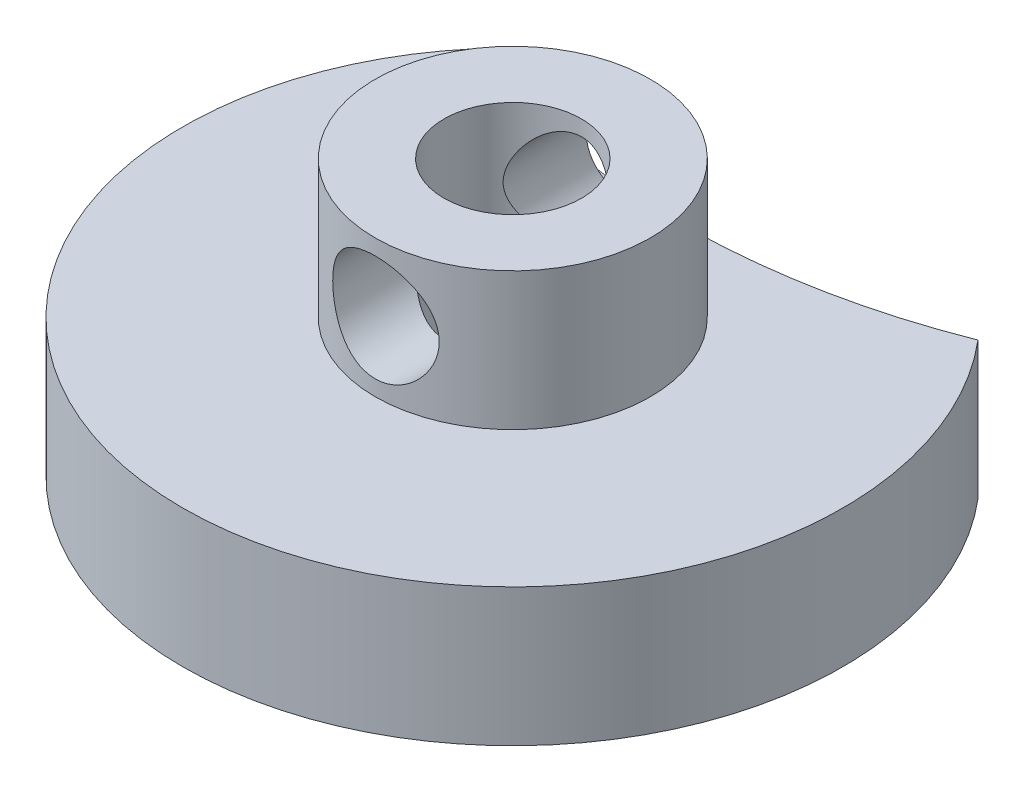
ISO-10303-21;
HEADER;
FILE_DESCRIPTION(('STEP AP214'),'2;1');
FILE_NAME('part.step','',(''),(''),'','','');
FILE_SCHEMA(('AUTOMOTIVE_DESIGN { 1 0 10303 214 1 1 1 1 }'));
ENDSEC;
DATA;
#1=APPLICATION_CONTEXT('core data for automotive mechanical design processes');
#2=APPLICATION_PROTOCOL_DEFINITION('international standard','automotive_design',2000,#1);
#3=PRODUCT_CONTEXT('',#1,'mechanical');
#4=PRODUCT('Part','Part','',(#3));
#5=PRODUCT_RELATED_PRODUCT_CATEGORY('part','',(#4));
#6=PRODUCT_DEFINITION_FORMATION('','',#4);
#7=PRODUCT_DEFINITION_CONTEXT('part definition',#1,'design');
#8=PRODUCT_DEFINITION('design','',#6,#7);
#9=PRODUCT_DEFINITION_SHAPE('','',#8);
#10=(LENGTH_UNIT() NAMED_UNIT(*) SI_UNIT(.MILLI.,.METRE.));
#11=(NAMED_UNIT(*) PLANE_ANGLE_UNIT() SI_UNIT($,.RADIAN.));
#12=(NAMED_UNIT(*) SI_UNIT($,.STERADIAN.) SOLID_ANGLE_UNIT());
#13=UNCERTAINTY_MEASURE_WITH_UNIT(LENGTH_MEASURE(1.E-05),#10,'distance_accuracy_value','');
#14=(GEOMETRIC_REPRESENTATION_CONTEXT(3) GLOBAL_UNCERTAINTY_ASSIGNED_CONTEXT((#13)) GLOBAL_UNIT_ASSIGNED_CONTEXT((#10,
#11,#12)) REPRESENTATION_CONTEXT('',''));
#15=CARTESIAN_POINT('',(0.,0.,0.));
#16=DIRECTION('',(0.,0.,1.));
#17=DIRECTION('',(1.,0.,0.));
#18=AXIS2_PLACEMENT_3D('',#15,#16,#17);
#19=CARTESIAN_POINT('',(0.,3.175,0.));
#20=DIRECTION('',(0.,1.,0.));
#21=DIRECTION('',(0.,0.,1.));
#22=AXIS2_PLACEMENT_3D('',#19,#20,#21);
#23=PLANE('',#22);
#24=CARTESIAN_POINT('',(0.,3.175,-39.37));
#25=DIRECTION('',(0.,1.,0.));
#26=DIRECTION('',(0.,0.,1.));
#27=AXIS2_PLACEMENT_3D('',#24,#25,#26);
#28=CIRCLE('',#27,31.75);
#29=CARTESIAN_POINT('',(-11.6440672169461,3.175,-9.83225806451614));
#30=VERTEX_POINT('',#29);
#31=CARTESIAN_POINT('',(11.644067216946,3.175,-9.83225806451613));
#32=VERTEX_POINT('',#31);
#33=EDGE_CURVE('E66',#30,#32,#28,.T.);
#34=ORIENTED_EDGE('',*,*,#33,.F.);
#35=CARTESIAN_POINT('',(0.,3.175,0.));
#36=DIRECTION('',(0.,1.,0.));
#37=DIRECTION('',(0.,0.,1.));
#38=AXIS2_PLACEMENT_3D('',#35,#36,#37);
#39=CIRCLE('',#38,15.24);
#40=EDGE_CURVE('E12',#30,#32,#39,.T.);
#41=ORIENTED_EDGE('',*,*,#40,.T.);
#42=EDGE_LOOP('',(#34,#41));
#43=FACE_BOUND('',#42,.T.);
#44=CARTESIAN_POINT('',(0.,3.175,0.));
#45=DIRECTION('',(0.,1.,0.));
#46=DIRECTION('',(0.,0.,1.));
#47=AXIS2_PLACEMENT_3D('',#44,#45,#46);
#48=CIRCLE('',#47,6.35);
#49=CARTESIAN_POINT('',(0.,3.175,6.35));
#50=VERTEX_POINT('',#49);
#51=EDGE_CURVE('E76',#50,#50,#48,.T.);
#52=ORIENTED_EDGE('',*,*,#51,.F.);
#53=EDGE_LOOP('',(#52));
#54=FACE_BOUND('',#53,.T.);
#55=ADVANCED_FACE('F33',(#43,#54),#23,.T.);
#56=CARTESIAN_POINT('',(0.,-3.175,0.));
#57=DIRECTION('',(0.,1.,0.));
#58=DIRECTION('',(0.,0.,1.));
#59=AXIS2_PLACEMENT_3D('',#56,#57,#58);
#60=PLANE('',#59);
#61=CARTESIAN_POINT('',(0.,-3.175,0.));
#62=DIRECTION('',(0.,1.,0.));
#63=DIRECTION('',(0.,0.,1.));
#64=AXIS2_PLACEMENT_3D('',#61,#62,#63);
#65=CIRCLE('',#64,15.24);
#66=CARTESIAN_POINT('',(-11.644067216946,-3.175,-9.83225806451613));
#67=VERTEX_POINT('',#66);
#68=CARTESIAN_POINT('',(11.644067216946,-3.175,-9.83225806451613));
#69=VERTEX_POINT('',#68);
#70=EDGE_CURVE('E46',#67,#69,#65,.T.);
#71=ORIENTED_EDGE('',*,*,#70,.F.);
#72=CARTESIAN_POINT('',(0.,-3.175,-39.37));
#73=DIRECTION('',(0.,1.,0.));
#74=DIRECTION('',(0.,0.,1.));
#75=AXIS2_PLACEMENT_3D('',#72,#73,#74);
#76=CIRCLE('',#75,31.75);
#77=EDGE_CURVE('E54',#67,#69,#76,.T.);
#78=ORIENTED_EDGE('',*,*,#77,.T.);
#79=EDGE_LOOP('',(#71,#78));
#80=FACE_BOUND('',#79,.T.);
#81=CARTESIAN_POINT('',(0.,-3.175,0.));
#82=DIRECTION('',(0.,1.,0.));
#83=DIRECTION('',(0.,0.,1.));
#84=AXIS2_PLACEMENT_3D('',#81,#82,#83);
#85=CIRCLE('',#84,6.35);
#86=CARTESIAN_POINT('',(0.,-3.175,-6.35));
#87=VERTEX_POINT('',#86);
#88=EDGE_CURVE('E74',#87,#87,#85,.F.);
#89=ORIENTED_EDGE('',*,*,#88,.F.);
#90=EDGE_LOOP('',(#89));
#91=FACE_BOUND('',#90,.T.);
#92=ADVANCED_FACE('F119',(#80,#91),#60,.F.);
#93=CARTESIAN_POINT('',(0.,3.175,0.));
#94=DIRECTION('',(0.,-1.,0.));
#95=DIRECTION('',(0.,0.,-1.));
#96=AXIS2_PLACEMENT_3D('',#93,#94,#95);
#97=CYLINDRICAL_SURFACE('',#96,15.24);
#98=ORIENTED_EDGE('',*,*,#70,.T.);
#99=DIRECTION('',(0.,1.,0.));
#100=VECTOR('',#99,1.);
#101=CARTESIAN_POINT('',(11.644067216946,-3.175,-9.83225806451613));
#102=LINE('',#101,#100);
#103=EDGE_CURVE('E59',#69,#32,#102,.T.);
#104=ORIENTED_EDGE('',*,*,#103,.T.);
#105=ORIENTED_EDGE('',*,*,#40,.F.);
#106=DIRECTION('',(0.,1.,0.));
#107=VECTOR('',#106,1.);
#108=CARTESIAN_POINT('',(-11.6440672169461,-3.175,-9.83225806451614));
#109=LINE('',#108,#107);
#110=EDGE_CURVE('E63',#67,#30,#109,.T.);
#111=ORIENTED_EDGE('',*,*,#110,.F.);
#112=EDGE_LOOP('',(#98,#104,#105,#111));
#113=FACE_BOUND('',#112,.T.);
#114=ADVANCED_FACE('F35',(#113),#97,.T.);
#115=CARTESIAN_POINT('',(0.,-3.175,-39.37));
#116=DIRECTION('',(0.,1.,0.));
#117=DIRECTION('',(0.,0.,1.));
#118=AXIS2_PLACEMENT_3D('',#115,#116,#117);
#119=CYLINDRICAL_SURFACE('',#118,31.75);
#120=ORIENTED_EDGE('',*,*,#33,.T.);
#121=ORIENTED_EDGE('',*,*,#103,.F.);
#122=ORIENTED_EDGE('',*,*,#77,.F.);
#123=ORIENTED_EDGE('',*,*,#110,.T.);
#124=EDGE_LOOP('',(#120,#121,#122,#123));
#125=FACE_BOUND('',#124,.T.);
#126=ADVANCED_FACE('F65',(#125),#119,.F.);
#127=CARTESIAN_POINT('',(0.,33.8355122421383,0.));
#128=DIRECTION('',(0.,-1.,0.));
#129=DIRECTION('',(0.,0.,-1.));
#130=AXIS2_PLACEMENT_3D('',#127,#128,#129);
#131=CYLINDRICAL_SURFACE('',#130,6.35);
#132=CARTESIAN_POINT('',(0.,-6.477,0.));
#133=DIRECTION('',(0.,1.,0.));
#134=DIRECTION('',(0.,0.,1.));
#135=AXIS2_PLACEMENT_3D('',#132,#133,#134);
#136=CIRCLE('',#135,6.35);
#137=CARTESIAN_POINT('',(0.,-6.477,-6.35));
#138=VERTEX_POINT('',#137);
#139=EDGE_CURVE('E218',#138,#138,#136,.F.);
#140=CARTESIAN_POINT('',(0.,-6.477,-6.35));
#141=CARTESIAN_POINT('',(0.,-6.44260416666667,-6.35));
#142=CARTESIAN_POINT('',(0.,-6.40820833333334,-6.35));
#143=CARTESIAN_POINT('',(0.,-6.33941666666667,-6.35));
#144=CARTESIAN_POINT('',(0.,-6.30502083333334,-6.35));
#145=CARTESIAN_POINT('',(0.,-6.23622916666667,-6.35));
#146=CARTESIAN_POINT('',(0.,-6.20183333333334,-6.35));
#147=CARTESIAN_POINT('',(0.,-6.13304166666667,-6.35));
#148=CARTESIAN_POINT('',(0.,-6.09864583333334,-6.35));
#149=CARTESIAN_POINT('',(0.,-6.02985416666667,-6.35));
#150=CARTESIAN_POINT('',(0.,-5.99545833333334,-6.35));
#151=CARTESIAN_POINT('',(0.,-5.92666666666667,-6.35));
#152=CARTESIAN_POINT('',(0.,-5.89227083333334,-6.35));
#153=CARTESIAN_POINT('',(0.,-5.82347916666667,-6.35));
#154=CARTESIAN_POINT('',(0.,-5.78908333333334,-6.35));
#155=CARTESIAN_POINT('',(0.,-5.72029166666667,-6.35));
#156=CARTESIAN_POINT('',(0.,-5.68589583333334,-6.35));
#157=CARTESIAN_POINT('',(0.,-5.61710416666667,-6.35));
#158=CARTESIAN_POINT('',(0.,-5.58270833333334,-6.35));
#159=CARTESIAN_POINT('',(0.,-5.51391666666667,-6.35));
#160=CARTESIAN_POINT('',(0.,-5.47952083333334,-6.35));
#161=CARTESIAN_POINT('',(0.,-5.41072916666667,-6.35));
#162=CARTESIAN_POINT('',(0.,-5.37633333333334,-6.35));
#163=CARTESIAN_POINT('',(0.,-5.30754166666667,-6.35));
#164=CARTESIAN_POINT('',(0.,-5.27314583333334,-6.35));
#165=CARTESIAN_POINT('',(0.,-5.20435416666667,-6.35));
#166=CARTESIAN_POINT('',(0.,-5.16995833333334,-6.35));
#167=CARTESIAN_POINT('',(0.,-5.10116666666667,-6.35));
#168=CARTESIAN_POINT('',(0.,-5.06677083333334,-6.35));
#169=CARTESIAN_POINT('',(0.,-4.99797916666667,-6.35));
#170=CARTESIAN_POINT('',(0.,-4.96358333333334,-6.35));
#171=CARTESIAN_POINT('',(0.,-4.89479166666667,-6.35));
#172=CARTESIAN_POINT('',(0.,-4.86039583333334,-6.35));
#173=CARTESIAN_POINT('',(0.,-4.79160416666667,-6.35));
#174=CARTESIAN_POINT('',(0.,-4.75720833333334,-6.35));
#175=CARTESIAN_POINT('',(0.,-4.68841666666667,-6.35));
#176=CARTESIAN_POINT('',(0.,-4.65402083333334,-6.35));
#177=CARTESIAN_POINT('',(0.,-4.58522916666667,-6.35));
#178=CARTESIAN_POINT('',(0.,-4.55083333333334,-6.35));
#179=CARTESIAN_POINT('',(0.,-4.48204166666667,-6.35));
#180=CARTESIAN_POINT('',(0.,-4.44764583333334,-6.35));
#181=CARTESIAN_POINT('',(0.,-4.37885416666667,-6.35));
#182=CARTESIAN_POINT('',(0.,-4.34445833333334,-6.35));
#183=CARTESIAN_POINT('',(0.,-4.27566666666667,-6.35));
#184=CARTESIAN_POINT('',(0.,-4.24127083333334,-6.35));
#185=CARTESIAN_POINT('',(0.,-4.17247916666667,-6.35));
#186=CARTESIAN_POINT('',(0.,-4.13808333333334,-6.35));
#187=CARTESIAN_POINT('',(0.,-4.06929166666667,-6.35));
#188=CARTESIAN_POINT('',(0.,-4.03489583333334,-6.35));
#189=CARTESIAN_POINT('',(0.,-3.96610416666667,-6.35));
#190=CARTESIAN_POINT('',(0.,-3.93170833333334,-6.35));
#191=CARTESIAN_POINT('',(0.,-3.86291666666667,-6.35));
#192=CARTESIAN_POINT('',(0.,-3.82852083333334,-6.35));
#193=CARTESIAN_POINT('',(0.,-3.75972916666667,-6.35));
#194=CARTESIAN_POINT('',(0.,-3.72533333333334,-6.35));
#195=CARTESIAN_POINT('',(0.,-3.65654166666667,-6.35));
#196=CARTESIAN_POINT('',(0.,-3.62214583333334,-6.35));
#197=CARTESIAN_POINT('',(0.,-3.55335416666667,-6.35));
#198=CARTESIAN_POINT('',(0.,-3.51895833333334,-6.35));
#199=CARTESIAN_POINT('',(0.,-3.45016666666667,-6.35));
#200=CARTESIAN_POINT('',(0.,-3.41577083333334,-6.35));
#201=CARTESIAN_POINT('',(0.,-3.34697916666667,-6.35));
#202=CARTESIAN_POINT('',(0.,-3.31258333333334,-6.35));
#203=CARTESIAN_POINT('',(0.,-3.24379166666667,-6.35));
#204=CARTESIAN_POINT('',(0.,-3.20939583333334,-6.35));
#205=CARTESIAN_POINT('',(0.,-3.175,-6.35));
#206=B_SPLINE_CURVE_WITH_KNOTS('',3,(#140,#141,#142,#143,#144,#145,#146,#147,#148,#149,#150,
#151,#152,#153,#154,#155,#156,#157,#158,#159,#160,#161,#162,#163,#164,#165,#166,#167,#168,#169,
#170,#171,#172,#173,#174,#175,#176,#177,#178,#179,#180,#181,#182,#183,#184,#185,#186,#187,#188,
#189,#190,#191,#192,#193,#194,#195,#196,#197,#198,#199,#200,#201,#202,#203,#204,#205),
.UNSPECIFIED.,.F.,.F.,(4,2,2,2,2,2,2,2,2,2,2,2,2,2,2,2,2,2,2,2,2,2,2,2,2,2,2,2,2,2,2,2,4),(0.,
0.103187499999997,0.206375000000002,0.309562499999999,0.412750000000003,0.515937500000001,
0.619124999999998,0.722312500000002,0.8255,0.928687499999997,1.031875,1.1350625,1.23825,
1.3414375,1.444625,1.5478125,1.651,1.7541875,1.857375,1.9605625,2.06375,2.1669375,2.270125,
2.3733125,2.4765,2.5796875,2.682875,2.7860625,2.88925,2.9924375,3.095625,3.1988125,3.302),.UNSPECIFIED.);
#207=EDGE_CURVE('BSEAM114',#138,#87,#206,.T.);
#208=ORIENTED_EDGE('',*,*,#139,.F.);
#209=ORIENTED_EDGE('',*,*,#88,.T.);
#210=ORIENTED_EDGE('',*,*,#207,.T.);
#211=ORIENTED_EDGE('',*,*,#207,.F.);
#212=EDGE_LOOP('',(#208,#210,#209,#211));
#213=FACE_BOUND('',#212,.T.);
#214=ADVANCED_FACE('F114',(#213),#131,.T.);
#215=CARTESIAN_POINT('',(0.,3.89255,6.35));
#216=CARTESIAN_POINT('',(-0.132781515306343,3.8925437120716,6.35000481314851));
#217=CARTESIAN_POINT('',(-0.265521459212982,3.90334482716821,6.34579969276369));
#218=CARTESIAN_POINT('',(-0.52701790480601,3.94607547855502,6.32944710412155));
#219=CARTESIAN_POINT('',(-0.655775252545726,3.97800049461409,6.31730133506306));
#220=CARTESIAN_POINT('',(-0.905495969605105,4.06166966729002,6.28636607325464));
#221=CARTESIAN_POINT('',(-1.02647440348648,4.11337408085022,6.26758990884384));
#222=CARTESIAN_POINT('',(-1.25802647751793,4.23492536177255,6.22525027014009));
#223=CARTESIAN_POINT('',(-1.36859713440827,4.3047774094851,6.20168542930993));
#224=CARTESIAN_POINT('',(-1.58114850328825,4.46390342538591,6.15100739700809));
#225=CARTESIAN_POINT('',(-1.68260214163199,4.55384769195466,6.12378935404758));
#226=CARTESIAN_POINT('',(-1.86941624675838,4.74918198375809,6.06937124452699));
#227=CARTESIAN_POINT('',(-1.95477131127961,4.85457717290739,6.0421711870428));
#228=CARTESIAN_POINT('',(-2.11042683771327,5.08309839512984,5.98962735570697));
#229=CARTESIAN_POINT('',(-2.17996410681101,5.20677524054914,5.96440587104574));
#230=CARTESIAN_POINT('',(-2.29701498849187,5.46519610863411,5.92031786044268));
#231=CARTESIAN_POINT('',(-2.34453805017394,5.59993535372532,5.90144860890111));
#232=CARTESIAN_POINT('',(-2.41409986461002,5.87057471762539,5.87332810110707));
#233=CARTESIAN_POINT('',(-2.43714907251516,6.00617429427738,5.86369722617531));
#234=CARTESIAN_POINT('',(-2.46026717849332,6.27963240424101,5.85403779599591));
#235=CARTESIAN_POINT('',(-2.46034637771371,6.41748989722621,5.85400493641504));
#236=CARTESIAN_POINT('',(-2.43829146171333,6.68209108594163,5.86321961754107));
#237=CARTESIAN_POINT('',(-2.41758760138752,6.80897875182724,5.87186961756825));
#238=CARTESIAN_POINT('',(-2.35692835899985,7.05731424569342,5.89647764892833));
#239=CARTESIAN_POINT('',(-2.31696988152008,7.1787611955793,5.91243685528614));
#240=CARTESIAN_POINT('',(-2.21819401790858,7.41558221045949,5.95020571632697));
#241=CARTESIAN_POINT('',(-2.15902133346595,7.53078995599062,5.97212421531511));
#242=CARTESIAN_POINT('',(-2.02374515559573,7.75004450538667,6.01930874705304));
#243=CARTESIAN_POINT('',(-1.94763555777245,7.85408726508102,6.04457598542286));
#244=CARTESIAN_POINT('',(-1.77420365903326,8.05593446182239,6.09782699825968));
#245=CARTESIAN_POINT('',(-1.67574913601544,8.15275149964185,6.1258754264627));
#246=CARTESIAN_POINT('',(-1.46368932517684,8.32880481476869,6.17997383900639));
#247=CARTESIAN_POINT('',(-1.35008140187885,8.4080380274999,6.20602347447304));
#248=CARTESIAN_POINT('',(-1.10828817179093,8.54785981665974,6.25376877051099));
#249=CARTESIAN_POINT('',(-0.979883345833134,8.60809944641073,6.27538065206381));
#250=CARTESIAN_POINT('',(-0.713715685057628,8.70578875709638,6.31118847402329));
#251=CARTESIAN_POINT('',(-0.575957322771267,8.7432492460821,6.32538793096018));
#252=CARTESIAN_POINT('',(-0.303287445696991,8.79237211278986,6.34414204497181));
#253=CARTESIAN_POINT('',(-0.168649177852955,8.80536284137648,6.34919270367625));
#254=CARTESIAN_POINT('',(0.100963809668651,8.80907107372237,6.3506269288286));
#255=CARTESIAN_POINT('',(0.235938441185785,8.79979390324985,6.34701256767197));
#256=CARTESIAN_POINT('',(0.496520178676,8.76022424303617,6.33184908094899));
#257=CARTESIAN_POINT('',(0.622283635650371,8.73081916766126,6.32063520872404));
#258=CARTESIAN_POINT('',(0.866990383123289,8.65301525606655,6.2917421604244));
#259=CARTESIAN_POINT('',(0.985932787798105,8.604613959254,6.27406214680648));
#260=CARTESIAN_POINT('',(1.21763122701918,8.48862659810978,6.23330841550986));
#261=CARTESIAN_POINT('',(1.33009422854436,8.42050807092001,6.2100886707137));
#262=CARTESIAN_POINT('',(1.54237981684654,8.26761615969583,6.16080025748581));
#263=CARTESIAN_POINT('',(1.64219751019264,8.18283636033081,6.13473049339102));
#264=CARTESIAN_POINT('',(1.83282355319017,7.99287006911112,6.08059859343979));
#265=CARTESIAN_POINT('',(1.92269330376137,7.88674596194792,6.05251292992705));
#266=CARTESIAN_POINT('',(2.0835553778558,7.66039532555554,5.99904180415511));
#267=CARTESIAN_POINT('',(2.1545453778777,7.54016706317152,5.97365667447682));
#268=CARTESIAN_POINT('',(2.2758721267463,7.28765892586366,5.92850284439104));
#269=CARTESIAN_POINT('',(2.32606902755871,7.15530453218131,5.90877244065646));
#270=CARTESIAN_POINT('',(2.40310491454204,6.88303618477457,5.87786888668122));
#271=CARTESIAN_POINT('',(2.42995965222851,6.74312739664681,5.86668996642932));
#272=CARTESIAN_POINT('',(2.45809413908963,6.46996536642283,5.85495377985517));
#273=CARTESIAN_POINT('',(2.46098782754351,6.3369059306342,5.85372634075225));
#274=CARTESIAN_POINT('',(2.44530202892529,6.07229885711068,5.86029601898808));
#275=CARTESIAN_POINT('',(2.42672486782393,5.94075105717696,5.86809215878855));
#276=CARTESIAN_POINT('',(2.36991134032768,5.68754799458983,5.89125663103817));
#277=CARTESIAN_POINT('',(2.33237817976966,5.56570790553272,5.90635333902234));
#278=CARTESIAN_POINT('',(2.23935547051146,5.32999349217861,5.94224368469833));
#279=CARTESIAN_POINT('',(2.18386125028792,5.21612124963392,5.96303880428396));
#280=CARTESIAN_POINT('',(2.0529696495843,4.99278387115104,6.00939937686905));
#281=CARTESIAN_POINT('',(1.9766482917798,4.88390212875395,6.03516378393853));
#282=CARTESIAN_POINT('',(1.80766081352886,4.67997819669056,6.08791357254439));
#283=CARTESIAN_POINT('',(1.71498933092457,4.58494056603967,6.11489935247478));
#284=CARTESIAN_POINT('',(1.509392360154,4.40565724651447,6.16896800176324));
#285=CARTESIAN_POINT('',(1.39559331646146,4.32238184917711,6.19596227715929));
#286=CARTESIAN_POINT('',(1.15466140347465,4.17613711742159,6.24534797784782));
#287=CARTESIAN_POINT('',(1.02752599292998,4.1131716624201,6.26773852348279));
#288=CARTESIAN_POINT('',(0.753939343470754,4.00613834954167,6.30669839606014));
#289=CARTESIAN_POINT('',(0.606757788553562,3.96372490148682,6.32274307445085));
#290=CARTESIAN_POINT('',(0.306363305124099,3.9069426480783,6.34438801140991));
#291=CARTESIAN_POINT('',(0.15315399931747,3.89255725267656,6.34999444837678));
#292=CARTESIAN_POINT('',(0.,3.89255,6.35));
#293=B_SPLINE_CURVE_WITH_KNOTS('',3,(#215,#216,#217,#218,#219,#220,#221,#222,#223,#224,#225,
#226,#227,#228,#229,#230,#231,#232,#233,#234,#235,#236,#237,#238,#239,#240,#241,#242,#243,#244,
#245,#246,#247,#248,#249,#250,#251,#252,#253,#254,#255,#256,#257,#258,#259,#260,#261,#262,#263,
#264,#265,#266,#267,#268,#269,#270,#271,#272,#273,#274,#275,#276,#277,#278,#279,#280,#281,#282,
#283,#284,#285,#286,#287,#288,#289,#290,#291,#292),.UNSPECIFIED.,.T.,.F.,(4,2,2,2,2,2,2,2,2,2,2,
2,2,2,2,2,2,2,2,2,2,2,2,2,2,2,2,2,2,2,2,2,2,2,2,2,2,2,4),(0.,0.39777929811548,0.795473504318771,
1.19237277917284,1.58938547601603,2.00242776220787,2.41560840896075,2.84577576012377,
3.27575830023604,3.6872013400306,4.09845986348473,4.4832324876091,4.86806698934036,
5.2604668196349,5.65300830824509,6.07379210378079,6.49464917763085,6.92283980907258,
7.35082711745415,7.7548246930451,8.15872565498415,8.54587768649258,8.93307988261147,
9.33190958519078,9.730893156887,10.1545450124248,10.5782489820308,11.0047581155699,
11.4309792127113,11.8282363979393,12.225450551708,12.6089067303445,12.9924627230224,
13.3970357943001,13.80174179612,14.2303758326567,14.6590916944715,15.1181735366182,
15.5769835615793),.UNSPECIFIED.);
#294=CARTESIAN_POINT('',(0.,3.89255,6.35));
#295=VERTEX_POINT('',#294);
#296=EDGE_CURVE('E106',#295,#295,#293,.T.);
#297=ORIENTED_EDGE('',*,*,#296,.T.);
#298=EDGE_LOOP('',(#297));
#299=FACE_BOUND('',#298,.T.);
#300=CARTESIAN_POINT('',(0.,8.80745000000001,-6.35));
#301=CARTESIAN_POINT('',(-0.132781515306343,8.80745628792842,-6.35000481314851));
#302=CARTESIAN_POINT('',(-0.265521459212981,8.79665517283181,-6.34579969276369));
#303=CARTESIAN_POINT('',(-0.52701790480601,8.75392452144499,-6.32944710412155));
#304=CARTESIAN_POINT('',(-0.655775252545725,8.72199950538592,-6.31730133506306));
#305=CARTESIAN_POINT('',(-0.905495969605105,8.63833033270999,-6.28636607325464));
#306=CARTESIAN_POINT('',(-1.02647440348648,8.58662591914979,-6.26758990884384));
#307=CARTESIAN_POINT('',(-1.25802647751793,8.46507463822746,-6.22525027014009));
#308=CARTESIAN_POINT('',(-1.36859713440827,8.39522259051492,-6.20168542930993));
#309=CARTESIAN_POINT('',(-1.58114850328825,8.23609657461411,-6.15100739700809));
#310=CARTESIAN_POINT('',(-1.68260214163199,8.14615230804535,-6.12378935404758));
#311=CARTESIAN_POINT('',(-1.86941624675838,7.95081801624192,-6.06937124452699));
#312=CARTESIAN_POINT('',(-1.95477131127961,7.84542282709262,-6.0421711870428));
#313=CARTESIAN_POINT('',(-2.11042683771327,7.61690160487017,-5.98962735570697));
#314=CARTESIAN_POINT('',(-2.17996410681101,7.49322475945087,-5.96440587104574));
#315=CARTESIAN_POINT('',(-2.29701498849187,7.2348038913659,-5.92031786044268));
#316=CARTESIAN_POINT('',(-2.34453805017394,7.10006464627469,-5.90144860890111));
#317=CARTESIAN_POINT('',(-2.41409986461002,6.82942528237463,-5.87332810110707));
#318=CARTESIAN_POINT('',(-2.43714907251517,6.69382570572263,-5.86369722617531));
#319=CARTESIAN_POINT('',(-2.46026717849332,6.420367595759,-5.85403779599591));
#320=CARTESIAN_POINT('',(-2.46034637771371,6.2825101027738,-5.85400493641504));
#321=CARTESIAN_POINT('',(-2.43829146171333,6.01790891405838,-5.86321961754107));
#322=CARTESIAN_POINT('',(-2.41758760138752,5.89102124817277,-5.87186961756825));
#323=CARTESIAN_POINT('',(-2.35692835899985,5.64268575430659,-5.89647764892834));
#324=CARTESIAN_POINT('',(-2.31696988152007,5.52123880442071,-5.91243685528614));
#325=CARTESIAN_POINT('',(-2.21819401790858,5.28441778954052,-5.95020571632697));
#326=CARTESIAN_POINT('',(-2.15902133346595,5.16921004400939,-5.97212421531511));
#327=CARTESIAN_POINT('',(-2.02374515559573,4.94995549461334,-6.01930874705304));
#328=CARTESIAN_POINT('',(-1.94763555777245,4.84591273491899,-6.04457598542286));
#329=CARTESIAN_POINT('',(-1.77420365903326,4.64406553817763,-6.09782699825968));
#330=CARTESIAN_POINT('',(-1.67574913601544,4.54724850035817,-6.1258754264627));
#331=CARTESIAN_POINT('',(-1.46368932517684,4.37119518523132,-6.17997383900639));
#332=CARTESIAN_POINT('',(-1.35008140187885,4.29196197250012,-6.20602347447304));
#333=CARTESIAN_POINT('',(-1.10828817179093,4.15214018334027,-6.25376877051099));
#334=CARTESIAN_POINT('',(-0.979883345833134,4.09190055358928,-6.27538065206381));
#335=CARTESIAN_POINT('',(-0.713715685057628,3.99421124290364,-6.31118847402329));
#336=CARTESIAN_POINT('',(-0.575957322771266,3.95675075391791,-6.32538793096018));
#337=CARTESIAN_POINT('',(-0.303287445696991,3.90762788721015,-6.34414204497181));
#338=CARTESIAN_POINT('',(-0.168649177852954,3.89463715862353,-6.34919270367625));
#339=CARTESIAN_POINT('',(0.100963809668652,3.89092892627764,-6.3506269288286));
#340=CARTESIAN_POINT('',(0.235938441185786,3.90020609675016,-6.34701256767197));
#341=CARTESIAN_POINT('',(0.496520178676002,3.93977575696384,-6.33184908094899));
#342=CARTESIAN_POINT('',(0.622283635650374,3.96918083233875,-6.32063520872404));
#343=CARTESIAN_POINT('',(0.866990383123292,4.04698474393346,-6.2917421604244));
#344=CARTESIAN_POINT('',(0.985932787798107,4.09538604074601,-6.27406214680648));
#345=CARTESIAN_POINT('',(1.21763122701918,4.21137340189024,-6.23330841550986));
#346=CARTESIAN_POINT('',(1.33009422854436,4.27949192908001,-6.2100886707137));
#347=CARTESIAN_POINT('',(1.54237981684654,4.43238384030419,-6.16080025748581));
#348=CARTESIAN_POINT('',(1.64219751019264,4.51716363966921,-6.13473049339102));
#349=CARTESIAN_POINT('',(1.83282355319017,4.70712993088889,-6.08059859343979));
#350=CARTESIAN_POINT('',(1.92269330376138,4.81325403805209,-6.05251292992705));
#351=CARTESIAN_POINT('',(2.0835553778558,5.03960467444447,-5.99904180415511));
#352=CARTESIAN_POINT('',(2.1545453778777,5.15983293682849,-5.97365667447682));
#353=CARTESIAN_POINT('',(2.2758721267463,5.41234107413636,-5.92850284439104));
#354=CARTESIAN_POINT('',(2.32606902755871,5.5446954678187,-5.90877244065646));
#355=CARTESIAN_POINT('',(2.40310491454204,5.81696381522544,-5.87786888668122));
#356=CARTESIAN_POINT('',(2.42995965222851,5.9568726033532,-5.86668996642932));
#357=CARTESIAN_POINT('',(2.45809413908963,6.23003463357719,-5.85495377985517));
#358=CARTESIAN_POINT('',(2.46098782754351,6.36309406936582,-5.85372634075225));
#359=CARTESIAN_POINT('',(2.44530202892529,6.62770114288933,-5.86029601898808));
#360=CARTESIAN_POINT('',(2.42672486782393,6.75924894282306,-5.86809215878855));
#361=CARTESIAN_POINT('',(2.36991134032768,7.01245200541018,-5.89125663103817));
#362=CARTESIAN_POINT('',(2.33237817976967,7.13429209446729,-5.90635333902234));
#363=CARTESIAN_POINT('',(2.23935547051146,7.37000650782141,-5.94224368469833));
#364=CARTESIAN_POINT('',(2.18386125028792,7.4838787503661,-5.96303880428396));
#365=CARTESIAN_POINT('',(2.0529696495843,7.70721612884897,-6.00939937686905));
#366=CARTESIAN_POINT('',(1.9766482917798,7.81609787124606,-6.03516378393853));
#367=CARTESIAN_POINT('',(1.80766081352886,8.02002180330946,-6.08791357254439));
#368=CARTESIAN_POINT('',(1.71498933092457,8.11505943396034,-6.11489935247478));
#369=CARTESIAN_POINT('',(1.509392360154,8.29434275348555,-6.16896800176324));
#370=CARTESIAN_POINT('',(1.39559331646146,8.3776181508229,-6.19596227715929));
#371=CARTESIAN_POINT('',(1.15466140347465,8.52386288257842,-6.24534797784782));
#372=CARTESIAN_POINT('',(1.02752599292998,8.58682833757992,-6.26773852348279));
#373=CARTESIAN_POINT('',(0.753939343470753,8.69386165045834,-6.30669839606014));
#374=CARTESIAN_POINT('',(0.60675778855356,8.73627509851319,-6.32274307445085));
#375=CARTESIAN_POINT('',(0.306363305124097,8.79305735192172,-6.34438801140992));
#376=CARTESIAN_POINT('',(0.153153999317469,8.80744274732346,-6.34999444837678));
#377=CARTESIAN_POINT('',(0.,8.80745000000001,-6.35));
#378=B_SPLINE_CURVE_WITH_KNOTS('',3,(#300,#301,#302,#303,#304,#305,#306,#307,#308,#309,#310,
#311,#312,#313,#314,#315,#316,#317,#318,#319,#320,#321,#322,#323,#324,#325,#326,#327,#328,#329,
#330,#331,#332,#333,#334,#335,#336,#337,#338,#339,#340,#341,#342,#343,#344,#345,#346,#347,#348,
#349,#350,#351,#352,#353,#354,#355,#356,#357,#358,#359,#360,#361,#362,#363,#364,#365,#366,#367,
#368,#369,#370,#371,#372,#373,#374,#375,#376,#377),.UNSPECIFIED.,.T.,.F.,(4,2,2,2,2,2,2,2,2,2,2,
2,2,2,2,2,2,2,2,2,2,2,2,2,2,2,2,2,2,2,2,2,2,2,2,2,2,2,4),(0.,0.39777929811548,0.795473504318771,
1.19237277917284,1.58938547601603,2.00242776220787,2.41560840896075,2.84577576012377,
3.27575830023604,3.6872013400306,4.09845986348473,4.48323248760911,4.86806698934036,
5.2604668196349,5.65300830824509,6.07379210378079,6.49464917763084,6.92283980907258,
7.35082711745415,7.7548246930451,8.15872565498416,8.54587768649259,8.93307988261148,
9.33190958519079,9.730893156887,10.1545450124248,10.5782489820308,11.0047581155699,
11.4309792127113,11.8282363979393,12.225450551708,12.6089067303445,12.9924627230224,
13.3970357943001,13.80174179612,14.2303758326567,14.6590916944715,15.1181735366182,
15.5769835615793),.UNSPECIFIED.);
#379=CARTESIAN_POINT('',(0.,8.80745000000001,-6.35));
#380=VERTEX_POINT('',#379);
#381=EDGE_CURVE('E102',#380,#380,#378,.T.);
#382=ORIENTED_EDGE('',*,*,#381,.T.);
#383=EDGE_LOOP('',(#382));
#384=FACE_BOUND('',#383,.T.);
#385=ORIENTED_EDGE('',*,*,#51,.T.);
#386=EDGE_LOOP('',(#385));
#387=FACE_BOUND('',#386,.T.);
#388=CARTESIAN_POINT('',(0.,9.525,0.));
#389=DIRECTION('',(0.,1.,0.));
#390=DIRECTION('',(0.,0.,1.));
#391=AXIS2_PLACEMENT_3D('',#388,#389,#390);
#392=CIRCLE('',#391,6.35);
#393=CARTESIAN_POINT('',(0.,9.525,6.35));
#394=VERTEX_POINT('',#393);
#395=EDGE_CURVE('E211',#394,#394,#392,.T.);
#396=ORIENTED_EDGE('',*,*,#395,.F.);
#397=EDGE_LOOP('',(#396));
#398=FACE_BOUND('',#397,.T.);
#399=ADVANCED_FACE('F110',(#299,#384,#387,#398),#131,.T.);
#400=CARTESIAN_POINT('',(0.,33.8355122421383,0.));
#401=DIRECTION('',(0.,-1.,0.));
#402=DIRECTION('',(0.,0.,-1.));
#403=AXIS2_PLACEMENT_3D('',#400,#401,#402);
#404=CYLINDRICAL_SURFACE('',#403,3.175);
#405=CARTESIAN_POINT('',(0.,8.80745000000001,-3.175));
#406=CARTESIAN_POINT('',(-0.119115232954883,8.80744089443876,-3.17499120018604));
#407=CARTESIAN_POINT('',(-0.238324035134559,8.7987254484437,-3.16823242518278));
#408=CARTESIAN_POINT('',(-0.472878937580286,8.76444558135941,-3.14181436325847));
#409=CARTESIAN_POINT('',(-0.588219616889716,8.73885847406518,-3.12213770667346));
#410=CARTESIAN_POINT('',(-0.811116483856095,8.67262757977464,-3.07175919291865));
#411=CARTESIAN_POINT('',(-0.918713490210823,8.63207090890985,-3.04112115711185));
#412=CARTESIAN_POINT('',(-1.12481814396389,8.53785308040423,-2.9710729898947));
#413=CARTESIAN_POINT('',(-1.22332576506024,8.48419188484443,-2.93166283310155));
#414=CARTESIAN_POINT('',(-1.41899819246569,8.36001803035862,-2.84247925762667));
#415=CARTESIAN_POINT('',(-1.51516764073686,8.2883959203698,-2.79208011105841));
#416=CARTESIAN_POINT('',(-1.694883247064,8.13340678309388,-2.68679507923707));
#417=CARTESIAN_POINT('',(-1.77841118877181,8.0500231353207,-2.63190289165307));
#418=CARTESIAN_POINT('',(-1.94908467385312,7.85351764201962,-2.5089806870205));
#419=CARTESIAN_POINT('',(-2.03312097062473,7.73786145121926,-2.44067185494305));
#420=CARTESIAN_POINT('',(-2.1810020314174,7.49144860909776,-2.30945103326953));
#421=CARTESIAN_POINT('',(-2.24486939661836,7.36070908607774,-2.24653306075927));
#422=CARTESIAN_POINT('',(-2.33108700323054,7.13364067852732,-2.15617302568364));
#423=CARTESIAN_POINT('',(-2.36011690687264,7.04172018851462,-2.12408977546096));
#424=CARTESIAN_POINT('',(-2.40752671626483,6.85235536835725,-2.07020089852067));
#425=CARTESIAN_POINT('',(-2.42593166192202,6.75492462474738,-2.04837113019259));
#426=CARTESIAN_POINT('',(-2.45094624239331,6.55524288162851,-2.01839204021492));
#427=CARTESIAN_POINT('',(-2.45742376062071,6.45295061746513,-2.01039600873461));
#428=CARTESIAN_POINT('',(-2.45747606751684,6.24834919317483,-2.01033274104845));
#429=CARTESIAN_POINT('',(-2.45105105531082,6.14604003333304,-2.01826525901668));
#430=CARTESIAN_POINT('',(-2.4276333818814,5.95827493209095,-2.04633246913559));
#431=CARTESIAN_POINT('',(-2.41211917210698,5.87235398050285,-2.06475139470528));
#432=CARTESIAN_POINT('',(-2.37277339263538,5.70468334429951,-2.10985076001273));
#433=CARTESIAN_POINT('',(-2.34893241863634,5.62293849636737,-2.13654053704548));
#434=CARTESIAN_POINT('',(-2.27557652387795,5.41174893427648,-2.21513597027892));
#435=CARTESIAN_POINT('',(-2.21950448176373,5.2864568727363,-2.27205362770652));
#436=CARTESIAN_POINT('',(-2.08924122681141,5.04902358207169,-2.39240890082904));
#437=CARTESIAN_POINT('',(-2.01500350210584,4.93691722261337,-2.45586300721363));
#438=CARTESIAN_POINT('',(-1.84650779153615,4.72252482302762,-2.58509371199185));
#439=CARTESIAN_POINT('',(-1.75164356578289,4.62071563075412,-2.65087436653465));
#440=CARTESIAN_POINT('',(-1.54415392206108,4.43319590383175,-2.77685250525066));
#441=CARTESIAN_POINT('',(-1.43155993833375,4.34745745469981,-2.83705957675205));
#442=CARTESIAN_POINT('',(-1.21080933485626,4.20829775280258,-2.93710081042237));
#443=CARTESIAN_POINT('',(-1.10535535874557,4.15184475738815,-2.97865572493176));
#444=CARTESIAN_POINT('',(-0.884335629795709,4.05400662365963,-3.05157062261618));
#445=CARTESIAN_POINT('',(-0.768775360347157,4.01261337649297,-3.08293609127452));
#446=CARTESIAN_POINT('',(-0.529210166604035,3.94697776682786,-3.1329897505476));
#447=CARTESIAN_POINT('',(-0.405149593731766,3.92286323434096,-3.15158341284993));
#448=CARTESIAN_POINT('',(-0.153486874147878,3.89408778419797,-3.17379605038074));
#449=CARTESIAN_POINT('',(-0.0258872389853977,3.88941340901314,-3.17742538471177));
#450=CARTESIAN_POINT('',(0.212655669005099,3.89921362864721,-3.16984491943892));
#451=CARTESIAN_POINT('',(0.323757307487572,3.91145384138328,-3.16036651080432));
#452=CARTESIAN_POINT('',(0.541817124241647,3.95046565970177,-3.13036324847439));
#453=CARTESIAN_POINT('',(0.64877465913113,3.97723951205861,-3.10983668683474));
#454=CARTESIAN_POINT('',(0.857340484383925,4.04431402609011,-3.05896540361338));
#455=CARTESIAN_POINT('',(0.958867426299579,4.08477600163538,-3.02850375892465));
#456=CARTESIAN_POINT('',(1.15353077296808,4.17742996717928,-2.95984107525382));
#457=CARTESIAN_POINT('',(1.24666570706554,4.22962400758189,-2.92163868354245));
#458=CARTESIAN_POINT('',(1.4377785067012,4.35330362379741,-2.8330549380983));
#459=CARTESIAN_POINT('',(1.53416983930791,4.42653725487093,-2.78170292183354));
#460=CARTESIAN_POINT('',(1.71404460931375,4.58492035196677,-2.67463311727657));
#461=CARTESIAN_POINT('',(1.79750566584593,4.67009000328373,-2.61890800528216));
#462=CARTESIAN_POINT('',(1.96720672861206,4.87019211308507,-2.49478217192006));
#463=CARTESIAN_POINT('',(2.05036167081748,4.98762100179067,-2.42617306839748));
#464=CARTESIAN_POINT('',(2.19610245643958,5.23775084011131,-2.29506009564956));
#465=CARTESIAN_POINT('',(2.2587183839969,5.3704290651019,-2.23254739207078));
#466=CARTESIAN_POINT('',(2.34178168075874,5.59904541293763,-2.14450729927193));
#467=CARTESIAN_POINT('',(2.36926013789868,5.69042616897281,-2.1138514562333));
#468=CARTESIAN_POINT('',(2.41370239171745,5.87841884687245,-2.06296185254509));
#469=CARTESIAN_POINT('',(2.43069165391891,5.97501747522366,-2.04270287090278));
#470=CARTESIAN_POINT('',(2.4530631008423,6.17254986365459,-2.015799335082));
#471=CARTESIAN_POINT('',(2.45832590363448,6.27351763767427,-2.00929484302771));
#472=CARTESIAN_POINT('',(2.45633308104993,6.47515555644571,-2.01172829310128));
#473=CARTESIAN_POINT('',(2.44907335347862,6.57582559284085,-2.02067129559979));
#474=CARTESIAN_POINT('',(2.42174831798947,6.7809866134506,-2.05334324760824));
#475=CARTESIAN_POINT('',(2.40073082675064,6.88516567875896,-2.07816824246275));
#476=CARTESIAN_POINT('',(2.34667455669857,7.08699170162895,-2.13901589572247));
#477=CARTESIAN_POINT('',(2.31360329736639,7.18462015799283,-2.17506877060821));
#478=CARTESIAN_POINT('',(2.22006776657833,7.41381695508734,-2.27115176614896));
#479=CARTESIAN_POINT('',(2.1539490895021,7.54154758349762,-2.33477122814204));
#480=CARTESIAN_POINT('',(2.00201909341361,7.78222270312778,-2.46631496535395));
#481=CARTESIAN_POINT('',(1.91617970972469,7.89514575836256,-2.53424527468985));
#482=CARTESIAN_POINT('',(1.7230565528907,8.10821834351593,-2.66945241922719));
#483=CARTESIAN_POINT('',(1.61527063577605,8.20795654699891,-2.73666569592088));
#484=CARTESIAN_POINT('',(1.38045725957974,8.38843367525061,-2.86227301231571));
#485=CARTESIAN_POINT('',(1.25346977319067,8.46921119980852,-2.92068488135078));
#486=CARTESIAN_POINT('',(1.01631094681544,8.59035267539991,-3.0099056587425));
#487=CARTESIAN_POINT('',(0.909940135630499,8.63577129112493,-3.04396212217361));
#488=CARTESIAN_POINT('',(0.689331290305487,8.71165521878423,-3.10134756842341));
#489=CARTESIAN_POINT('',(0.575109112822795,8.74214971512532,-3.12469748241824));
#490=CARTESIAN_POINT('',(0.383434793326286,8.77855675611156,-3.15267748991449));
#491=CARTESIAN_POINT('',(0.307413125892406,8.78935855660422,-3.16101463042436));
#492=CARTESIAN_POINT('',(0.154274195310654,8.80380880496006,-3.17217925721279));
#493=CARTESIAN_POINT('',(0.0771567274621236,8.80745589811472,-3.17500570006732));
#494=CARTESIAN_POINT('',(0.,8.80745000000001,-3.175));
#495=B_SPLINE_CURVE_WITH_KNOTS('',3,(#405,#406,#407,#408,#409,#410,#411,#412,#413,#414,#415,
#416,#417,#418,#419,#420,#421,#422,#423,#424,#425,#426,#427,#428,#429,#430,#431,#432,#433,#434,
#435,#436,#437,#438,#439,#440,#441,#442,#443,#444,#445,#446,#447,#448,#449,#450,#451,#452,#453,
#454,#455,#456,#457,#458,#459,#460,#461,#462,#463,#464,#465,#466,#467,#468,#469,#470,#471,#472,
#473,#474,#475,#476,#477,#478,#479,#480,#481,#482,#483,#484,#485,#486,#487,#488,#489,#490,#491,
#492,#493,#494),.UNSPECIFIED.,.T.,.F.,(4,2,2,2,2,2,2,2,2,2,2,2,2,2,2,2,2,2,2,2,2,2,2,2,2,2,2,2,
2,2,2,2,2,2,2,2,2,2,2,2,2,2,2,2,4),(0.,0.357020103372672,0.714521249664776,1.06997388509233,
1.42542754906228,1.81427094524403,2.20366943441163,2.67710082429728,3.14999979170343,
3.45383041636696,3.75694204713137,4.06339141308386,4.36983604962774,4.63654119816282,
4.90354854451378,5.34689823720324,5.79139519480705,6.251343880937,6.71048609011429,
7.08887266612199,7.46705519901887,7.84800746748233,8.22869597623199,8.56362126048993,
8.89859833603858,9.23766920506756,9.57679937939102,9.96987882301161,10.3636312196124,
10.8399252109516,11.3155184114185,11.6152384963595,11.9142280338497,12.2162478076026,
12.5183665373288,12.8439862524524,13.1704899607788,13.639837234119,14.1098566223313,
14.5921690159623,15.0734908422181,15.4337853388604,15.7933724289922,16.0245879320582,
16.2558472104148),.UNSPECIFIED.);
#496=CARTESIAN_POINT('',(0.,8.80745000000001,-3.175));
#497=VERTEX_POINT('',#496);
#498=EDGE_CURVE('E37',#497,#497,#495,.T.);
#499=ORIENTED_EDGE('',*,*,#498,.F.);
#500=EDGE_LOOP('',(#499));
#501=FACE_BOUND('',#500,.T.);
#502=CARTESIAN_POINT('',(0.,3.89255000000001,3.175));
#503=CARTESIAN_POINT('',(-0.119115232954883,3.89255910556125,3.17499120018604));
#504=CARTESIAN_POINT('',(-0.238324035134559,3.90127455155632,3.16823242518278));
#505=CARTESIAN_POINT('',(-0.472878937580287,3.9355544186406,3.14181436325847));
#506=CARTESIAN_POINT('',(-0.588219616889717,3.96114152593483,3.12213770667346));
#507=CARTESIAN_POINT('',(-0.811116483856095,4.02737242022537,3.07175919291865));
#508=CARTESIAN_POINT('',(-0.918713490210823,4.06792909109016,3.04112115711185));
#509=CARTESIAN_POINT('',(-1.12481814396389,4.16214691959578,2.9710729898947));
#510=CARTESIAN_POINT('',(-1.22332576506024,4.21580811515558,2.93166283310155));
#511=CARTESIAN_POINT('',(-1.41899819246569,4.3399819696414,2.84247925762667));
#512=CARTESIAN_POINT('',(-1.51516764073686,4.41160407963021,2.79208011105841));
#513=CARTESIAN_POINT('',(-1.694883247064,4.56659321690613,2.68679507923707));
#514=CARTESIAN_POINT('',(-1.77841118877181,4.64997686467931,2.63190289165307));
#515=CARTESIAN_POINT('',(-1.94908467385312,4.84648235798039,2.5089806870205));
#516=CARTESIAN_POINT('',(-2.03312097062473,4.96213854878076,2.44067185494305));
#517=CARTESIAN_POINT('',(-2.1810020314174,5.20855139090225,2.30945103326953));
#518=CARTESIAN_POINT('',(-2.24486939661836,5.33929091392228,2.24653306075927));
#519=CARTESIAN_POINT('',(-2.33108700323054,5.56635932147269,2.15617302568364));
#520=CARTESIAN_POINT('',(-2.36011690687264,5.65827981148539,2.12408977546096));
#521=CARTESIAN_POINT('',(-2.40752671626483,5.84764463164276,2.07020089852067));
#522=CARTESIAN_POINT('',(-2.42593166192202,5.94507537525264,2.04837113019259));
#523=CARTESIAN_POINT('',(-2.45094624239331,6.1447571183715,2.01839204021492));
#524=CARTESIAN_POINT('',(-2.45742376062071,6.24704938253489,2.01039600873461));
#525=CARTESIAN_POINT('',(-2.45747606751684,6.45165080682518,2.01033274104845));
#526=CARTESIAN_POINT('',(-2.45105105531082,6.55395996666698,2.01826525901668));
#527=CARTESIAN_POINT('',(-2.4276333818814,6.74172506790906,2.04633246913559));
#528=CARTESIAN_POINT('',(-2.41211917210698,6.82764601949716,2.06475139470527));
#529=CARTESIAN_POINT('',(-2.37277339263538,6.9953166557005,2.10985076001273));
#530=CARTESIAN_POINT('',(-2.34893241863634,7.07706150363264,2.13654053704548));
#531=CARTESIAN_POINT('',(-2.27557652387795,7.28825106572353,2.21513597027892));
#532=CARTESIAN_POINT('',(-2.21950448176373,7.41354312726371,2.27205362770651));
#533=CARTESIAN_POINT('',(-2.08924122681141,7.65097641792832,2.39240890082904));
#534=CARTESIAN_POINT('',(-2.01500350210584,7.76308277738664,2.45586300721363));
#535=CARTESIAN_POINT('',(-1.84650779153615,7.97747517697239,2.58509371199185));
#536=CARTESIAN_POINT('',(-1.75164356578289,8.0792843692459,2.65087436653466));
#537=CARTESIAN_POINT('',(-1.54415392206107,8.26680409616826,2.77685250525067));
#538=CARTESIAN_POINT('',(-1.43155993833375,8.3525425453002,2.83705957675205));
#539=CARTESIAN_POINT('',(-1.21080933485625,8.49170224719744,2.93710081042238));
#540=CARTESIAN_POINT('',(-1.10535535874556,8.54815524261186,2.97865572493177));
#541=CARTESIAN_POINT('',(-0.884335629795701,8.64599337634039,3.05157062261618));
#542=CARTESIAN_POINT('',(-0.76877536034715,8.68738662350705,3.08293609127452));
#543=CARTESIAN_POINT('',(-0.52921016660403,8.75302223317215,3.1329897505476));
#544=CARTESIAN_POINT('',(-0.405149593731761,8.77713676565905,3.15158341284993));
#545=CARTESIAN_POINT('',(-0.153486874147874,8.80591221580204,3.17379605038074));
#546=CARTESIAN_POINT('',(-0.0258872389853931,8.81058659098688,3.17742538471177));
#547=CARTESIAN_POINT('',(0.212655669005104,8.8007863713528,3.16984491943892));
#548=CARTESIAN_POINT('',(0.323757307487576,8.78854615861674,3.16036651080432));
#549=CARTESIAN_POINT('',(0.541817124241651,8.74953434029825,3.13036324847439));
#550=CARTESIAN_POINT('',(0.648774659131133,8.72276048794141,3.10983668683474));
#551=CARTESIAN_POINT('',(0.857340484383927,8.65568597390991,3.05896540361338));
#552=CARTESIAN_POINT('',(0.958867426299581,8.61522399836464,3.02850375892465));
#553=CARTESIAN_POINT('',(1.15353077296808,8.52257003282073,2.95984107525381));
#554=CARTESIAN_POINT('',(1.24666570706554,8.47037599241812,2.92163868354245));
#555=CARTESIAN_POINT('',(1.4377785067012,8.3466963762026,2.8330549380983));
#556=CARTESIAN_POINT('',(1.53416983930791,8.27346274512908,2.78170292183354));
#557=CARTESIAN_POINT('',(1.71404460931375,8.11507964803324,2.67463311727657));
#558=CARTESIAN_POINT('',(1.79750566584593,8.02990999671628,2.61890800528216));
#559=CARTESIAN_POINT('',(1.96720672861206,7.82980788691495,2.49478217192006));
#560=CARTESIAN_POINT('',(2.05036167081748,7.71237899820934,2.42617306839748));
#561=CARTESIAN_POINT('',(2.19610245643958,7.4622491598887,2.29506009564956));
#562=CARTESIAN_POINT('',(2.25871838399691,7.32957093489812,2.23254739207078));
#563=CARTESIAN_POINT('',(2.34178168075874,7.10095458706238,2.14450729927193));
#564=CARTESIAN_POINT('',(2.36926013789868,7.0095738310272,2.1138514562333));
#565=CARTESIAN_POINT('',(2.41370239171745,6.82158115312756,2.06296185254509));
#566=CARTESIAN_POINT('',(2.43069165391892,6.72498252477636,2.04270287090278));
#567=CARTESIAN_POINT('',(2.4530631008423,6.52745013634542,2.015799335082));
#568=CARTESIAN_POINT('',(2.45832590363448,6.42648236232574,2.00929484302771));
#569=CARTESIAN_POINT('',(2.45633308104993,6.2248444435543,2.01172829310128));
#570=CARTESIAN_POINT('',(2.44907335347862,6.12417440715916,2.02067129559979));
#571=CARTESIAN_POINT('',(2.42174831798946,5.91901338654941,2.05334324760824));
#572=CARTESIAN_POINT('',(2.40073082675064,5.81483432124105,2.07816824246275));
#573=CARTESIAN_POINT('',(2.34667455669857,5.61300829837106,2.13901589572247));
#574=CARTESIAN_POINT('',(2.31360329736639,5.51537984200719,2.17506877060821));
#575=CARTESIAN_POINT('',(2.22006776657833,5.28618304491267,2.27115176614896));
#576=CARTESIAN_POINT('',(2.1539490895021,5.1584524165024,2.33477122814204));
#577=CARTESIAN_POINT('',(2.00201909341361,4.91777729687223,2.46631496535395));
#578=CARTESIAN_POINT('',(1.91617970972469,4.80485424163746,2.53424527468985));
#579=CARTESIAN_POINT('',(1.7230565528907,4.59178165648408,2.66945241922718));
#580=CARTESIAN_POINT('',(1.61527063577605,4.4920434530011,2.73666569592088));
#581=CARTESIAN_POINT('',(1.38045725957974,4.31156632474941,2.86227301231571));
#582=CARTESIAN_POINT('',(1.25346977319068,4.2307888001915,2.92068488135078));
#583=CARTESIAN_POINT('',(1.01631094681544,4.1096473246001,3.0099056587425));
#584=CARTESIAN_POINT('',(0.909940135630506,4.06422870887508,3.04396212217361));
#585=CARTESIAN_POINT('',(0.689331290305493,3.98834478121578,3.10134756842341));
#586=CARTESIAN_POINT('',(0.575109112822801,3.9578502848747,3.12469748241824));
#587=CARTESIAN_POINT('',(0.38343479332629,3.92144324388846,3.15267748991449));
#588=CARTESIAN_POINT('',(0.30741312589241,3.91064144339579,3.16101463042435));
#589=CARTESIAN_POINT('',(0.154274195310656,3.89619119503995,3.17217925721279));
#590=CARTESIAN_POINT('',(0.077156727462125,3.8925441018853,3.17500570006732));
#591=CARTESIAN_POINT('',(0.,3.89255000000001,3.175));
#592=B_SPLINE_CURVE_WITH_KNOTS('',3,(#502,#503,#504,#505,#506,#507,#508,#509,#510,#511,#512,
#513,#514,#515,#516,#517,#518,#519,#520,#521,#522,#523,#524,#525,#526,#527,#528,#529,#530,#531,
#532,#533,#534,#535,#536,#537,#538,#539,#540,#541,#542,#543,#544,#545,#546,#547,#548,#549,#550,
#551,#552,#553,#554,#555,#556,#557,#558,#559,#560,#561,#562,#563,#564,#565,#566,#567,#568,#569,
#570,#571,#572,#573,#574,#575,#576,#577,#578,#579,#580,#581,#582,#583,#584,#585,#586,#587,#588,
#589,#590,#591),.UNSPECIFIED.,.T.,.F.,(4,2,2,2,2,2,2,2,2,2,2,2,2,2,2,2,2,2,2,2,2,2,2,2,2,2,2,2,
2,2,2,2,2,2,2,2,2,2,2,2,2,2,2,2,4),(0.,0.357020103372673,0.714521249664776,1.06997388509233,
1.42542754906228,1.81427094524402,2.20366943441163,2.67710082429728,3.14999979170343,
3.45383041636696,3.75694204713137,4.06339141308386,4.36983604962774,4.63654119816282,
4.90354854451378,5.34689823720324,5.79139519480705,6.25134388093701,6.7104860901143,
7.088872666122,7.46705519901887,7.84800746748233,8.22869597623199,8.56362126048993,
8.89859833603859,9.23766920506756,9.57679937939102,9.96987882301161,10.3636312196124,
10.8399252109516,11.3155184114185,11.6152384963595,11.9142280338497,12.2162478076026,
12.5183665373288,12.8439862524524,13.1704899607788,13.639837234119,14.1098566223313,
14.5921690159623,15.0734908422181,15.4337853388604,15.7933724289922,16.0245879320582,
16.2558472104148),.UNSPECIFIED.);
#593=CARTESIAN_POINT('',(0.,3.89255000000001,3.175));
#594=VERTEX_POINT('',#593);
#595=EDGE_CURVE('E82',#594,#594,#592,.T.);
#596=ORIENTED_EDGE('',*,*,#595,.F.);
#597=EDGE_LOOP('',(#596));
#598=FACE_BOUND('',#597,.T.);
#599=CARTESIAN_POINT('',(0.,9.525,0.));
#600=DIRECTION('',(0.,1.,0.));
#601=DIRECTION('',(0.,0.,1.));
#602=AXIS2_PLACEMENT_3D('',#599,#600,#601);
#603=CIRCLE('',#602,3.175);
#604=CARTESIAN_POINT('',(0.,9.525,3.175));
#605=VERTEX_POINT('',#604);
#606=EDGE_CURVE('E213',#605,#605,#603,.T.);
#607=ORIENTED_EDGE('',*,*,#606,.T.);
#608=EDGE_LOOP('',(#607));
#609=FACE_BOUND('',#608,.T.);
#610=CARTESIAN_POINT('',(0.,-6.477,0.));
#611=DIRECTION('',(0.,1.,0.));
#612=DIRECTION('',(0.,0.,1.));
#613=AXIS2_PLACEMENT_3D('',#610,#611,#612);
#614=CIRCLE('',#613,3.175);
#615=CARTESIAN_POINT('',(0.,-6.477,3.175));
#616=VERTEX_POINT('',#615);
#617=EDGE_CURVE('E221',#616,#616,#614,.F.);
#618=ORIENTED_EDGE('',*,*,#617,.T.);
#619=EDGE_LOOP('',(#618));
#620=FACE_BOUND('',#619,.T.);
#621=ADVANCED_FACE('F86',(#501,#598,#609,#620),#404,.F.);
#622=CARTESIAN_POINT('',(0.,9.525,0.));
#623=DIRECTION('',(0.,1.,0.));
#624=DIRECTION('',(0.,0.,1.));
#625=AXIS2_PLACEMENT_3D('',#622,#623,#624);
#626=PLANE('',#625);
#627=ORIENTED_EDGE('',*,*,#606,.F.);
#628=EDGE_LOOP('',(#627));
#629=FACE_BOUND('',#628,.T.);
#630=ORIENTED_EDGE('',*,*,#395,.T.);
#631=EDGE_LOOP('',(#630));
#632=FACE_BOUND('',#631,.T.);
#633=ADVANCED_FACE('F156',(#629,#632),#626,.T.);
#634=CARTESIAN_POINT('',(0.,-6.477,0.));
#635=DIRECTION('',(0.,1.,0.));
#636=DIRECTION('',(0.,0.,1.));
#637=AXIS2_PLACEMENT_3D('',#634,#635,#636);
#638=PLANE('',#637);
#639=ORIENTED_EDGE('',*,*,#139,.T.);
#640=EDGE_LOOP('',(#639));
#641=FACE_BOUND('',#640,.T.);
#642=ORIENTED_EDGE('',*,*,#617,.F.);
#643=EDGE_LOOP('',(#642));
#644=FACE_BOUND('',#643,.T.);
#645=ADVANCED_FACE('F95',(#641,#644),#638,.F.);
#646=CARTESIAN_POINT('',(0.,6.35,6.35));
#647=DIRECTION('',(0.,0.,1.));
#648=DIRECTION('',(0.,-1.,0.));
#649=AXIS2_PLACEMENT_3D('',#646,#647,#648);
#650=CYLINDRICAL_SURFACE('',#649,2.45745);
#651=ORIENTED_EDGE('',*,*,#595,.T.);
#652=EDGE_LOOP('',(#651));
#653=FACE_BOUND('',#652,.T.);
#654=ORIENTED_EDGE('',*,*,#296,.F.);
#655=EDGE_LOOP('',(#654));
#656=FACE_BOUND('',#655,.T.);
#657=ADVANCED_FACE('F90',(#653,#656),#650,.F.);
#658=ORIENTED_EDGE('',*,*,#498,.T.);
#659=EDGE_LOOP('',(#658));
#660=FACE_BOUND('',#659,.T.);
#661=ORIENTED_EDGE('',*,*,#381,.F.);
#662=EDGE_LOOP('',(#661));
#663=FACE_BOUND('',#662,.T.);
#664=ADVANCED_FACE('F94',(#660,#663),#650,.F.);
#665=CLOSED_SHELL('',(#55,#92,#114,#126,#214,#399,#621,#633,#645,#657,#664));
#666=MANIFOLD_SOLID_BREP('B2',#665);
#667=ADVANCED_BREP_SHAPE_REPRESENTATION('',(#18,#666),#14);
#668=SHAPE_DEFINITION_REPRESENTATION(#9,#667);
ENDSEC;
END-ISO-10303-21;
